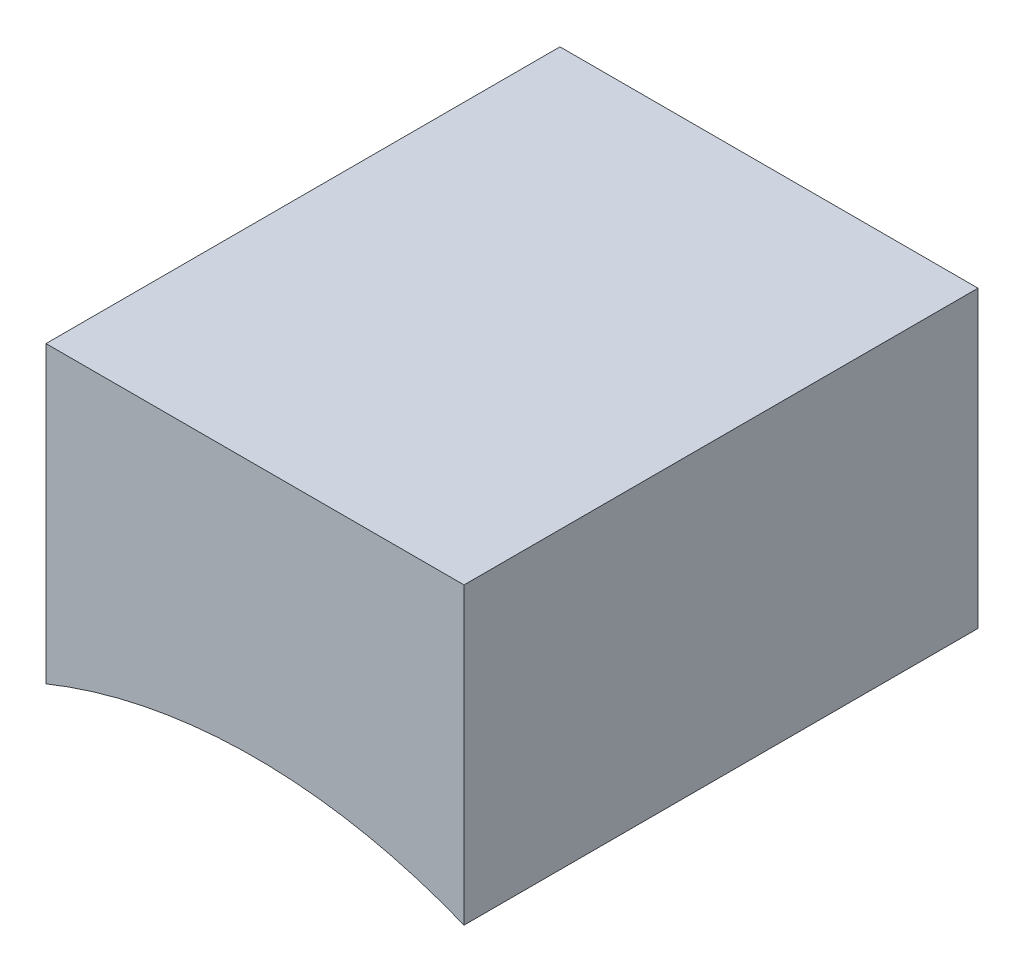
ISO-10303-21;
HEADER;
FILE_DESCRIPTION(('STEP AP214'),'2;1');
FILE_NAME('part.step','',(''),(''),'','','');
FILE_SCHEMA(('AUTOMOTIVE_DESIGN { 1 0 10303 214 1 1 1 1 }'));
ENDSEC;
DATA;
#1=APPLICATION_CONTEXT('core data for automotive mechanical design processes');
#2=APPLICATION_PROTOCOL_DEFINITION('international standard','automotive_design',2000,#1);
#3=PRODUCT_CONTEXT('',#1,'mechanical');
#4=PRODUCT('Part','Part','',(#3));
#5=PRODUCT_RELATED_PRODUCT_CATEGORY('part','',(#4));
#6=PRODUCT_DEFINITION_FORMATION('','',#4);
#7=PRODUCT_DEFINITION_CONTEXT('part definition',#1,'design');
#8=PRODUCT_DEFINITION('design','',#6,#7);
#9=PRODUCT_DEFINITION_SHAPE('','',#8);
#10=(LENGTH_UNIT() NAMED_UNIT(*) SI_UNIT(.MILLI.,.METRE.));
#11=(NAMED_UNIT(*) PLANE_ANGLE_UNIT() SI_UNIT($,.RADIAN.));
#12=(NAMED_UNIT(*) SI_UNIT($,.STERADIAN.) SOLID_ANGLE_UNIT());
#13=UNCERTAINTY_MEASURE_WITH_UNIT(LENGTH_MEASURE(1.E-05),#10,'distance_accuracy_value','');
#14=(GEOMETRIC_REPRESENTATION_CONTEXT(3) GLOBAL_UNCERTAINTY_ASSIGNED_CONTEXT((#13)) GLOBAL_UNIT_ASSIGNED_CONTEXT((#10,
#11,#12)) REPRESENTATION_CONTEXT('',''));
#15=CARTESIAN_POINT('',(0.,0.,0.));
#16=DIRECTION('',(0.,0.,1.));
#17=DIRECTION('',(1.,0.,0.));
#18=AXIS2_PLACEMENT_3D('',#15,#16,#17);
#19=CARTESIAN_POINT('',(0.,0.,19.05));
#20=DIRECTION('',(0.,0.,-1.));
#21=DIRECTION('',(-1.,0.,0.));
#22=AXIS2_PLACEMENT_3D('',#19,#20,#21);
#23=CYLINDRICAL_SURFACE('',#22,20.6502);
#24=CARTESIAN_POINT('',(0.,0.,0.));
#25=DIRECTION('',(0.,0.,-1.));
#26=DIRECTION('',(1.,0.,0.));
#27=AXIS2_PLACEMENT_3D('',#24,#25,#26);
#28=CIRCLE('',#27,20.6502);
#29=CARTESIAN_POINT('',(-7.747,19.1419630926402,0.));
#30=VERTEX_POINT('',#29);
#31=CARTESIAN_POINT('',(7.747,19.1419630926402,0.));
#32=VERTEX_POINT('',#31);
#33=EDGE_CURVE('E79',#30,#32,#28,.T.);
#34=ORIENTED_EDGE('',*,*,#33,.T.);
#35=DIRECTION('',(0.,0.,-1.));
#36=VECTOR('',#35,1.);
#37=CARTESIAN_POINT('',(7.747,19.1419630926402,19.05));
#38=LINE('',#37,#36);
#39=CARTESIAN_POINT('',(7.747,19.1419630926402,19.05));
#40=VERTEX_POINT('',#39);
#41=EDGE_CURVE('E11',#40,#32,#38,.T.);
#42=ORIENTED_EDGE('',*,*,#41,.F.);
#43=CARTESIAN_POINT('',(0.,0.,19.05));
#44=DIRECTION('',(0.,0.,-1.));
#45=DIRECTION('',(1.,0.,0.));
#46=AXIS2_PLACEMENT_3D('',#43,#44,#45);
#47=CIRCLE('',#46,20.6502);
#48=CARTESIAN_POINT('',(-7.747,19.1419630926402,19.05));
#49=VERTEX_POINT('',#48);
#50=EDGE_CURVE('E97',#49,#40,#47,.T.);
#51=ORIENTED_EDGE('',*,*,#50,.F.);
#52=DIRECTION('',(0.,0.,-1.));
#53=VECTOR('',#52,1.);
#54=CARTESIAN_POINT('',(-7.747,19.1419630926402,19.05));
#55=LINE('',#54,#53);
#56=EDGE_CURVE('E91',#49,#30,#55,.T.);
#57=ORIENTED_EDGE('',*,*,#56,.T.);
#58=EDGE_LOOP('',(#34,#42,#51,#57));
#59=FACE_BOUND('',#58,.T.);
#60=ADVANCED_FACE('F35',(#59),#23,.F.);
#61=CARTESIAN_POINT('',(7.747,19.1419630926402,19.05));
#62=DIRECTION('',(-1.,0.,0.));
#63=DIRECTION('',(0.,0.,1.));
#64=AXIS2_PLACEMENT_3D('',#61,#62,#63);
#65=PLANE('',#64);
#66=DIRECTION('',(0.,1.,0.));
#67=VECTOR('',#66,1.);
#68=CARTESIAN_POINT('',(7.747,19.1419630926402,0.));
#69=LINE('',#68,#67);
#70=CARTESIAN_POINT('',(7.747,30.0639630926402,0.));
#71=VERTEX_POINT('',#70);
#72=EDGE_CURVE('E75',#32,#71,#69,.T.);
#73=ORIENTED_EDGE('',*,*,#72,.T.);
#74=DIRECTION('',(0.,0.,-1.));
#75=VECTOR('',#74,1.);
#76=CARTESIAN_POINT('',(7.747,30.0639630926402,19.05));
#77=LINE('',#76,#75);
#78=CARTESIAN_POINT('',(7.747,30.0639630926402,19.05));
#79=VERTEX_POINT('',#78);
#80=EDGE_CURVE('E42',#79,#71,#77,.T.);
#81=ORIENTED_EDGE('',*,*,#80,.F.);
#82=DIRECTION('',(0.,1.,0.));
#83=VECTOR('',#82,1.);
#84=CARTESIAN_POINT('',(7.747,19.1419630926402,19.05));
#85=LINE('',#84,#83);
#86=EDGE_CURVE('E87',#40,#79,#85,.T.);
#87=ORIENTED_EDGE('',*,*,#86,.F.);
#88=ORIENTED_EDGE('',*,*,#41,.T.);
#89=EDGE_LOOP('',(#73,#81,#87,#88));
#90=FACE_BOUND('',#89,.T.);
#91=ADVANCED_FACE('F86',(#90),#65,.F.);
#92=CARTESIAN_POINT('',(7.747,30.0639630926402,19.05));
#93=DIRECTION('',(0.,-1.,0.));
#94=DIRECTION('',(0.,0.,-1.));
#95=AXIS2_PLACEMENT_3D('',#92,#93,#94);
#96=PLANE('',#95);
#97=DIRECTION('',(-1.,0.,0.));
#98=VECTOR('',#97,1.);
#99=CARTESIAN_POINT('',(7.747,30.0639630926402,0.));
#100=LINE('',#99,#98);
#101=CARTESIAN_POINT('',(-7.747,30.0639630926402,0.));
#102=VERTEX_POINT('',#101);
#103=EDGE_CURVE('E80',#71,#102,#100,.T.);
#104=ORIENTED_EDGE('',*,*,#103,.T.);
#105=DIRECTION('',(0.,0.,-1.));
#106=VECTOR('',#105,1.);
#107=CARTESIAN_POINT('',(-7.747,30.0639630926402,19.05));
#108=LINE('',#107,#106);
#109=CARTESIAN_POINT('',(-7.747,30.0639630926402,19.05));
#110=VERTEX_POINT('',#109);
#111=EDGE_CURVE('E103',#110,#102,#108,.T.);
#112=ORIENTED_EDGE('',*,*,#111,.F.);
#113=DIRECTION('',(-1.,0.,0.));
#114=VECTOR('',#113,1.);
#115=CARTESIAN_POINT('',(7.747,30.0639630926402,19.05));
#116=LINE('',#115,#114);
#117=EDGE_CURVE('E54',#79,#110,#116,.T.);
#118=ORIENTED_EDGE('',*,*,#117,.F.);
#119=ORIENTED_EDGE('',*,*,#80,.T.);
#120=EDGE_LOOP('',(#104,#112,#118,#119));
#121=FACE_BOUND('',#120,.T.);
#122=ADVANCED_FACE('F106',(#121),#96,.F.);
#123=CARTESIAN_POINT('',(-7.747,30.0639630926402,19.05));
#124=DIRECTION('',(1.,0.,0.));
#125=DIRECTION('',(0.,1.,0.));
#126=AXIS2_PLACEMENT_3D('',#123,#124,#125);
#127=PLANE('',#126);
#128=DIRECTION('',(0.,-1.,0.));
#129=VECTOR('',#128,1.);
#130=CARTESIAN_POINT('',(-7.747,30.0639630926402,0.));
#131=LINE('',#130,#129);
#132=EDGE_CURVE('E95',#102,#30,#131,.T.);
#133=ORIENTED_EDGE('',*,*,#132,.T.);
#134=ORIENTED_EDGE('',*,*,#56,.F.);
#135=DIRECTION('',(0.,-1.,0.));
#136=VECTOR('',#135,1.);
#137=CARTESIAN_POINT('',(-7.747,30.0639630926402,19.05));
#138=LINE('',#137,#136);
#139=EDGE_CURVE('E49',#110,#49,#138,.T.);
#140=ORIENTED_EDGE('',*,*,#139,.F.);
#141=ORIENTED_EDGE('',*,*,#111,.T.);
#142=EDGE_LOOP('',(#133,#134,#140,#141));
#143=FACE_BOUND('',#142,.T.);
#144=ADVANCED_FACE('F108',(#143),#127,.F.);
#145=CARTESIAN_POINT('',(0.,0.,19.05));
#146=DIRECTION('',(0.,0.,1.));
#147=DIRECTION('',(1.,0.,0.));
#148=AXIS2_PLACEMENT_3D('',#145,#146,#147);
#149=PLANE('',#148);
#150=ORIENTED_EDGE('',*,*,#50,.T.);
#151=ORIENTED_EDGE('',*,*,#86,.T.);
#152=ORIENTED_EDGE('',*,*,#117,.T.);
#153=ORIENTED_EDGE('',*,*,#139,.T.);
#154=EDGE_LOOP('',(#150,#151,#152,#153));
#155=FACE_BOUND('',#154,.T.);
#156=ADVANCED_FACE('F109',(#155),#149,.T.);
#157=CARTESIAN_POINT('',(0.,0.,0.));
#158=DIRECTION('',(0.,0.,1.));
#159=DIRECTION('',(1.,0.,0.));
#160=AXIS2_PLACEMENT_3D('',#157,#158,#159);
#161=PLANE('',#160);
#162=ORIENTED_EDGE('',*,*,#33,.F.);
#163=ORIENTED_EDGE('',*,*,#132,.F.);
#164=ORIENTED_EDGE('',*,*,#103,.F.);
#165=ORIENTED_EDGE('',*,*,#72,.F.);
#166=EDGE_LOOP('',(#162,#163,#164,#165));
#167=FACE_BOUND('',#166,.T.);
#168=ADVANCED_FACE('F76',(#167),#161,.F.);
#169=CLOSED_SHELL('',(#60,#91,#122,#144,#156,#168));
#170=MANIFOLD_SOLID_BREP('B2',#169);
#171=ADVANCED_BREP_SHAPE_REPRESENTATION('',(#18,#170),#14);
#172=SHAPE_DEFINITION_REPRESENTATION(#9,#171);
ENDSEC;
END-ISO-10303-21;
